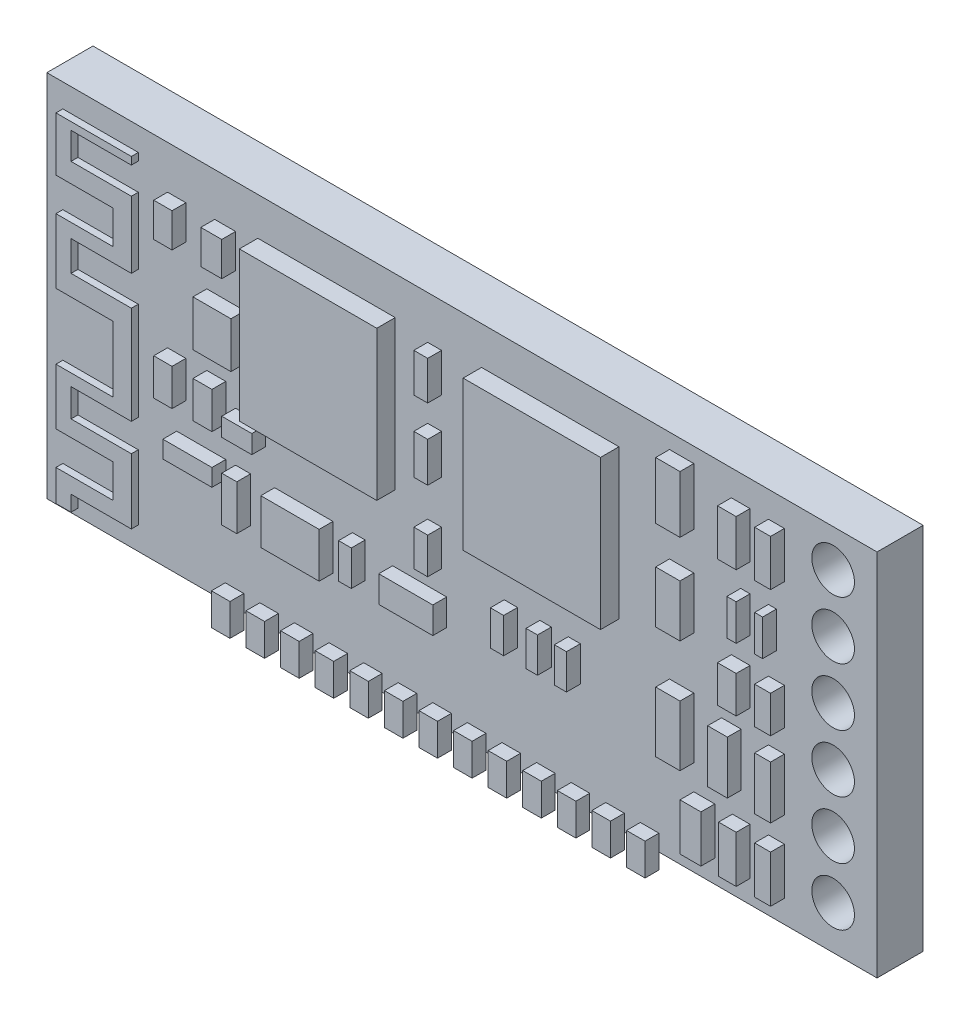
from build123d import *

# Parameters (mm, degrees)
SKETCH_1_W          = 3.6
SKETCH_1_H          = 1.6
EXTRUDE_1_DEPTH     = 0.2
SKETCH_2_R          = 0.092435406
CUT_EXTRUDE_1_DEPTH = 0.2
EXTRUDE_2_DEPTH     = 0.03
SKETCH_4_W          = 0.595744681
SKETCH_4_H          = 0.646808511
EXTRUDE_3_DEPTH     = 0.08
SKETCH_5_W          = 0.090780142
SKETCH_5_H          = 0.14751773
SKETCH_5_W_2        = 0.079432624
SKETCH_5_W_3        = 0.164539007
SKETCH_5_H_2        = 0.198581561
SKETCH_5_H_3        = 0.158865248
SKETCH_5_W_4        = 0.082269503
SKETCH_5_W_5        = 0.130302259
SKETCH_5_H_4        = 0.079432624
SKETCH_5_W_6        = 0.212765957
SKETCH_5_H_5        = 0.074616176
SKETCH_5_W_7        = 0.065151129
SKETCH_5_H_6        = 0.194650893
SKETCH_5_W_8        = 0.253046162
SKETCH_5_W_9        = 0.055151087
SKETCH_5_H_7        = 0.152476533
SKETCH_5_W_10       = 0.23436508
SKETCH_5_H_8        = 0.115168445
SKETCH_5_W_11       = 0.060174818
SKETCH_5_H_9        = 0.156542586
SKETCH_5_H_10       = 0.172459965
SKETCH_5_H_11       = 0.167950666
SKETCH_5_W_12       = 0.057599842
SKETCH_5_H_12       = 0.151573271
SKETCH_5_W_13       = 0.049745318
SKETCH_5_W_14       = 0.052363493
EXTRUDE_4_DEPTH     = 0.06
SKETCH_6_W          = 0.08046238
SKETCH_6_H          = 0.138574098
EXTRUDE_5_DEPTH     = 0.06
SKETCH_7_W          = 0.105461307
SKETCH_7_H          = 0.247288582
SKETCH_7_H_2        = 0.225469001
SKETCH_7_H_3        = 0.261834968
SKETCH_7_W_2        = 0.090914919
SKETCH_7_H_4        = 0.20364942
SKETCH_7_W_3        = 0.076368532
SKETCH_7_W_4        = 0.069095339
SKETCH_7_W_5        = 0.085460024
SKETCH_7_H_5        = 0.229105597
SKETCH_7_W_6        = 0.080914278
SKETCH_7_H_6        = 0.160010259
SKETCH_7_H_7        = 0.200012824
SKETCH_7_W_7        = 0.040457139
SKETCH_7_H_8        = 0.156373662
SKETCH_7_W_8        = 0.034547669
EXTRUDE_6_DEPTH     = 0.06


with BuildPart() as part:
    # Sketch 1 → Extrude 1 (new body)
    with BuildSketch(Plane.XY):
        with Locations((-48.531631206, 75.291914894)):
            Rectangle(SKETCH_1_W, SKETCH_1_H)
    extrude(amount=EXTRUDE_1_DEPTH)

    # Sketch 2 → Cut-Extrude 1 (cut)
    with BuildSketch(Plane.XY.offset(0.2)):
        with Locations((-46.922099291, 75.929191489)):
            Circle(SKETCH_2_R)
        with Locations((-46.922099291, 75.679191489)):
            Circle(SKETCH_2_R)
        with Locations((-46.922099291, 75.429191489)):
            Circle(SKETCH_2_R)
        with Locations((-46.922099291, 75.179191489)):
            Circle(SKETCH_2_R)
        with Locations((-46.922099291, 74.929191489)):
            Circle(SKETCH_2_R)
        with Locations((-46.922099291, 74.679191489)):
            Circle(SKETCH_2_R)
    extrude(amount=-CUT_EXTRUDE_1_DEPTH, mode=Mode.SUBTRACT)

    # Sketch 3 → Extrude 2 (add)
    with BuildSketch(Plane.XY.offset(0.2)):
        Polygon((-49.972547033, 75.990447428), (-50.262187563, 75.990447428), (-50.262187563, 75.756866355), (-50.014591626, 75.756866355), (-50.014591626, 75.61204609), (-50.262187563, 75.61204609), (-50.262187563, 75.331748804), (-50.014591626, 75.331748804), (-50.014591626, 75.046779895), (-50.262187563, 75.046779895), (-50.262187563, 74.80385558), (-50.014591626, 74.80385558), (-50.014591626, 74.659035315), (-50.262187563, 74.659035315), (-50.262187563, 74.523558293), (-50.196784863, 74.523558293), (-50.196784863, 74.591296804), (-49.935174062, 74.591296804), (-49.935174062, 74.873929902), (-50.196784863, 74.873929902), (-50.196784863, 74.995392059), (-49.935174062, 74.995392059), (-49.935174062, 75.420509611), (-50.196784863, 75.420509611), (-50.196784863, 75.551315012), (-49.935174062, 75.551315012), (-49.935174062, 75.840955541), (-50.196784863, 75.840955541), (-50.196784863, 75.957746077), (-49.935174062, 75.957746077), (-49.935174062, 75.990447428), align=None)
    extrude(amount=EXTRUDE_2_DEPTH)

    # Sketch 4 → Extrude 3 (add)
    with BuildSketch(Plane.XY.offset(0.2)):
        with Locations((-48.148652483, 75.603971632)):
            Rectangle(SKETCH_4_W, SKETCH_4_H)
        with Locations((-49.118865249, 75.603971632)):
            Rectangle(SKETCH_4_W, SKETCH_4_H)
    extrude(amount=EXTRUDE_3_DEPTH)

    # Sketch 5 → Extrude 4 (add)
    with BuildSketch(Plane.XY.offset(0.2)):
        with Locations((-49.55858156, 75.830921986)):
            Rectangle(SKETCH_5_W, SKETCH_5_H)
        with Locations((-49.768510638, 75.830921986)):
            Rectangle(SKETCH_5_W_2, SKETCH_5_H)
        with Locations((-49.555744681, 75.527375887)):
            Rectangle(SKETCH_5_W_3, SKETCH_5_H_2)
        with Locations((-49.768510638, 75.240851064)):
            Rectangle(SKETCH_5_W_2, SKETCH_5_H_3)
        with Locations((-49.596879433, 75.240851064)):
            Rectangle(SKETCH_5_W_4, SKETCH_5_H_3)
        with Locations((-49.448040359, 75.201134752)):
            Rectangle(SKETCH_5_W_5, SKETCH_5_H_4)
        with Locations((-49.66212766, 74.989689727)):
            Rectangle(SKETCH_5_W_6, SKETCH_5_H_5)
        with Locations((-49.480615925, 74.929672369)):
            Rectangle(SKETCH_5_W_7, SKETCH_5_H_6)
        with Locations((-49.21743597, 74.929672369)):
            Rectangle(SKETCH_5_W_8, SKETCH_5_H_6)
        with Locations((-48.978988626, 74.950759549)):
            Rectangle(SKETCH_5_W_9, SKETCH_5_H_7)
        with Locations((-48.715158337, 74.932105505)):
            Rectangle(SKETCH_5_W_10, SKETCH_5_H_8)
        with Locations((-48.650232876, 75.162579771)):
            Rectangle(SKETCH_5_W_11, SKETCH_5_H_9)
        with Locations((-48.650232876, 75.514315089)):
            Rectangle(SKETCH_5_W_11, SKETCH_5_H_10)
        with Locations((-48.650232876, 75.820705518)):
            Rectangle(SKETCH_5_W_11, SKETCH_5_H_11)
        with Locations((-48.319420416, 75.028168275)):
            Rectangle(SKETCH_5_W_12, SKETCH_5_H_12)
        with Locations((-48.168875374, 75.028168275)):
            Rectangle(SKETCH_5_W_13, SKETCH_5_H_12)
        with Locations((-48.044512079, 75.028168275)):
            Rectangle(SKETCH_5_W_14, SKETCH_5_H_12)
    extrude(amount=EXTRUDE_4_DEPTH)

    # Sketch 6 → Extrude 5 (add)
    with BuildSketch(Plane.XY.offset(0.2)):
        with Locations((-49.367773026, 74.493592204)):
            Rectangle(SKETCH_6_W, SKETCH_6_H)
        with Locations((-49.517773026, 74.493592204)):
            Rectangle(SKETCH_6_W, SKETCH_6_H)
        with Locations((-49.217773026, 74.493592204)):
            Rectangle(SKETCH_6_W, SKETCH_6_H)
        with Locations((-49.067773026, 74.493592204)):
            Rectangle(SKETCH_6_W, SKETCH_6_H)
        with Locations((-48.917773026, 74.493592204)):
            Rectangle(SKETCH_6_W, SKETCH_6_H)
        with Locations((-48.767773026, 74.493592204)):
            Rectangle(SKETCH_6_W, SKETCH_6_H)
        with Locations((-48.617773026, 74.493592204)):
            Rectangle(SKETCH_6_W, SKETCH_6_H)
        with Locations((-48.467773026, 74.493592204)):
            Rectangle(SKETCH_6_W, SKETCH_6_H)
        with Locations((-48.317773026, 74.493592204)):
            Rectangle(SKETCH_6_W, SKETCH_6_H)
        with Locations((-48.167773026, 74.493592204)):
            Rectangle(SKETCH_6_W, SKETCH_6_H)
        with Locations((-48.017773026, 74.493592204)):
            Rectangle(SKETCH_6_W, SKETCH_6_H)
        with Locations((-47.867773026, 74.493592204)):
            Rectangle(SKETCH_6_W, SKETCH_6_H)
        with Locations((-47.717773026, 74.493592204)):
            Rectangle(SKETCH_6_W, SKETCH_6_H)
    extrude(amount=EXTRUDE_5_DEPTH)

    # Sketch 7 → Extrude 6 (add)
    with BuildSketch(Plane.XY.offset(0.2)):
        with Locations((-47.578872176, 75.902953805)):
            Rectangle(SKETCH_7_W, SKETCH_7_H)
        with Locations((-47.578872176, 75.502928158)):
            Rectangle(SKETCH_7_W, SKETCH_7_H_2)
        with Locations((-47.578872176, 75.033807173)):
            Rectangle(SKETCH_7_W, SKETCH_7_H_3)
        with Locations((-47.480684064, 74.691967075)):
            Rectangle(SKETCH_7_W_2, SKETCH_7_H_4)
        with Locations((-47.320673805, 74.691967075)):
            Rectangle(SKETCH_7_W_3, SKETCH_7_H_4)
        with Locations((-47.167936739, 74.691967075)):
            Rectangle(SKETCH_7_W_4, SKETCH_7_H_4)
        with Locations((-47.363403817, 75.017442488)):
            Rectangle(SKETCH_7_W_5, SKETCH_7_H_5)
        with Locations((-47.167936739, 75.017442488)):
            Rectangle(SKETCH_7_W_4, SKETCH_7_H_5)
        with Locations((-47.322946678, 75.310188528)):
            Rectangle(SKETCH_7_W_6, SKETCH_7_H_6)
        with Locations((-47.167936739, 75.310188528)):
            Rectangle(SKETCH_7_W_4, SKETCH_7_H_6)
        with Locations((-47.322946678, 75.879315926)):
            Rectangle(SKETCH_7_W_6, SKETCH_7_H_7)
        with Locations((-47.167936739, 75.879315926)):
            Rectangle(SKETCH_7_W_4, SKETCH_7_H_7)
        with Locations((-47.302718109, 75.581114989)):
            Rectangle(SKETCH_7_W_7, SKETCH_7_H_8)
        with Locations((-47.185210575, 75.581114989)):
            Rectangle(SKETCH_7_W_8, SKETCH_7_H_8)
    extrude(amount=EXTRUDE_6_DEPTH)


solid = part.part
